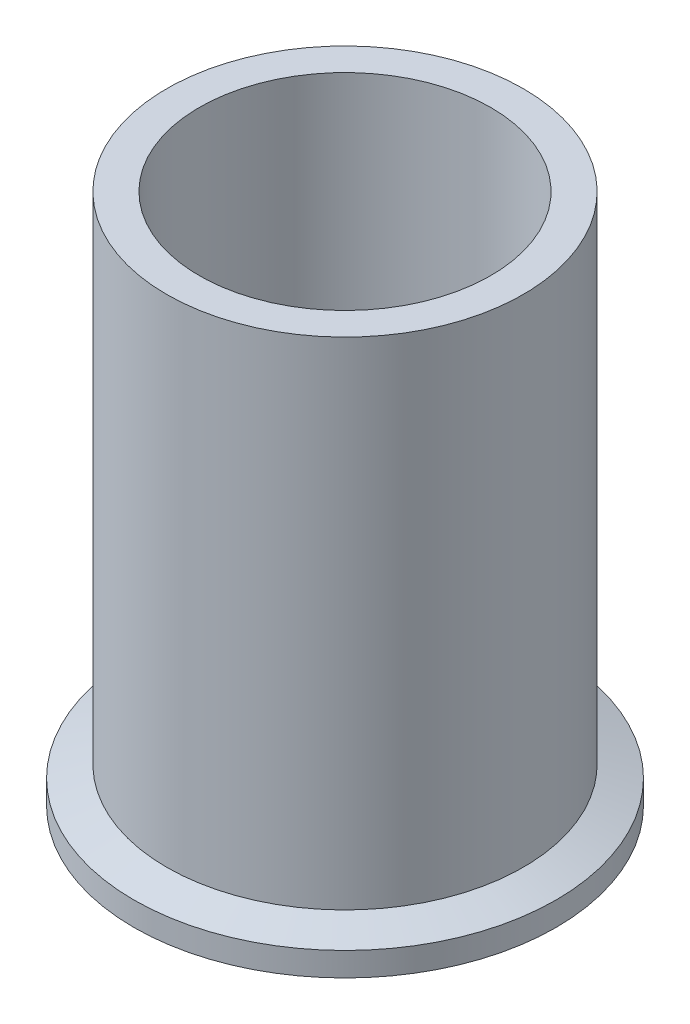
ISO-10303-21;
HEADER;
FILE_DESCRIPTION(('STEP AP214'),'2;1');
FILE_NAME('part.step','',(''),(''),'','','');
FILE_SCHEMA(('AUTOMOTIVE_DESIGN { 1 0 10303 214 1 1 1 1 }'));
ENDSEC;
DATA;
#1=APPLICATION_CONTEXT('core data for automotive mechanical design processes');
#2=APPLICATION_PROTOCOL_DEFINITION('international standard','automotive_design',2000,#1);
#3=PRODUCT_CONTEXT('',#1,'mechanical');
#4=PRODUCT('Part','Part','',(#3));
#5=PRODUCT_RELATED_PRODUCT_CATEGORY('part','',(#4));
#6=PRODUCT_DEFINITION_FORMATION('','',#4);
#7=PRODUCT_DEFINITION_CONTEXT('part definition',#1,'design');
#8=PRODUCT_DEFINITION('design','',#6,#7);
#9=PRODUCT_DEFINITION_SHAPE('','',#8);
#10=(LENGTH_UNIT() NAMED_UNIT(*) SI_UNIT(.MILLI.,.METRE.));
#11=(NAMED_UNIT(*) PLANE_ANGLE_UNIT() SI_UNIT($,.RADIAN.));
#12=(NAMED_UNIT(*) SI_UNIT($,.STERADIAN.) SOLID_ANGLE_UNIT());
#13=UNCERTAINTY_MEASURE_WITH_UNIT(LENGTH_MEASURE(1.E-05),#10,'distance_accuracy_value','');
#14=(GEOMETRIC_REPRESENTATION_CONTEXT(3) GLOBAL_UNCERTAINTY_ASSIGNED_CONTEXT((#13)) GLOBAL_UNIT_ASSIGNED_CONTEXT((#10,
#11,#12)) REPRESENTATION_CONTEXT('',''));
#15=CARTESIAN_POINT('',(0.,0.,0.));
#16=DIRECTION('',(0.,0.,1.));
#17=DIRECTION('',(1.,0.,0.));
#18=AXIS2_PLACEMENT_3D('',#15,#16,#17);
#19=CARTESIAN_POINT('',(0.,0.7874,0.));
#20=DIRECTION('',(0.,-1.,0.));
#21=DIRECTION('',(0.,0.,-1.));
#22=AXIS2_PLACEMENT_3D('',#19,#20,#21);
#23=TOROIDAL_SURFACE('',#22,23.6366084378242,0.787399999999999);
#24=CARTESIAN_POINT('',(0.,0.,0.));
#25=DIRECTION('',(0.,-1.,0.));
#26=DIRECTION('',(0.,0.,-1.));
#27=AXIS2_PLACEMENT_3D('',#24,#25,#26);
#28=CIRCLE('',#27,23.6366084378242);
#29=CARTESIAN_POINT('',(0.,0.,-23.6366084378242));
#30=VERTEX_POINT('',#29);
#31=EDGE_CURVE('E67',#30,#30,#28,.T.);
#32=ORIENTED_EDGE('',*,*,#31,.T.);
#33=EDGE_LOOP('',(#32));
#34=FACE_BOUND('',#33,.T.);
#35=CARTESIAN_POINT('',(0.,0.474458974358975,0.));
#36=DIRECTION('',(0.,-1.,0.));
#37=DIRECTION('',(0.,0.,-1.));
#38=AXIS2_PLACEMENT_3D('',#35,#36,#37);
#39=CIRCLE('',#38,22.9140666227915);
#40=CARTESIAN_POINT('',(0.,0.474458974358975,-22.9140666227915));
#41=VERTEX_POINT('',#40);
#42=EDGE_CURVE('E10',#41,#41,#39,.T.);
#43=ORIENTED_EDGE('',*,*,#42,.F.);
#44=EDGE_LOOP('',(#43));
#45=FACE_BOUND('',#44,.T.);
#46=ADVANCED_FACE('F33',(#34,#45),#23,.T.);
#47=CARTESIAN_POINT('',(0.,0.,0.));
#48=DIRECTION('',(0.,-1.,0.));
#49=DIRECTION('',(0.,0.,-1.));
#50=AXIS2_PLACEMENT_3D('',#47,#48,#49);
#51=TOROIDAL_SURFACE('',#50,21.8186,1.1938);
#52=CARTESIAN_POINT('',(0.,0.474458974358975,0.));
#53=DIRECTION('',(0.,-1.,0.));
#54=DIRECTION('',(0.,0.,-1.));
#55=AXIS2_PLACEMENT_3D('',#52,#53,#54);
#56=CIRCLE('',#55,20.7231333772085);
#57=CARTESIAN_POINT('',(0.,0.474458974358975,-20.7231333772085));
#58=VERTEX_POINT('',#57);
#59=EDGE_CURVE('E39',#58,#58,#56,.T.);
#60=ORIENTED_EDGE('',*,*,#59,.F.);
#61=EDGE_LOOP('',(#60));
#62=FACE_BOUND('',#61,.T.);
#63=ORIENTED_EDGE('',*,*,#42,.T.);
#64=EDGE_LOOP('',(#63));
#65=FACE_BOUND('',#64,.T.);
#66=ADVANCED_FACE('F115',(#62,#65),#51,.F.);
#67=CARTESIAN_POINT('',(0.,0.787400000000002,0.));
#68=DIRECTION('',(0.,-1.,0.));
#69=DIRECTION('',(0.,0.,-1.));
#70=AXIS2_PLACEMENT_3D('',#67,#68,#69);
#71=TOROIDAL_SURFACE('',#70,20.0005915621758,0.787399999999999);
#72=ORIENTED_EDGE('',*,*,#59,.T.);
#73=EDGE_LOOP('',(#72));
#74=FACE_BOUND('',#73,.T.);
#75=CARTESIAN_POINT('',(0.,0.,0.));
#76=DIRECTION('',(0.,-1.,0.));
#77=DIRECTION('',(0.,0.,-1.));
#78=AXIS2_PLACEMENT_3D('',#75,#76,#77);
#79=CIRCLE('',#78,20.0005915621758);
#80=CARTESIAN_POINT('',(0.,0.,-20.0005915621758));
#81=VERTEX_POINT('',#80);
#82=EDGE_CURVE('E43',#81,#81,#79,.T.);
#83=ORIENTED_EDGE('',*,*,#82,.F.);
#84=EDGE_LOOP('',(#83));
#85=FACE_BOUND('',#84,.T.);
#86=ADVANCED_FACE('F111',(#74,#85),#71,.T.);
#87=CARTESIAN_POINT('',(0.,0.,0.));
#88=DIRECTION('',(0.,1.,0.));
#89=DIRECTION('',(0.,0.,1.));
#90=AXIS2_PLACEMENT_3D('',#87,#88,#89);
#91=PLANE('',#90);
#92=CARTESIAN_POINT('',(0.,0.,0.));
#93=DIRECTION('',(0.,-1.,0.));
#94=DIRECTION('',(0.,0.,-1.));
#95=AXIS2_PLACEMENT_3D('',#92,#93,#94);
#96=CIRCLE('',#95,17.399);
#97=CARTESIAN_POINT('',(0.,0.,-17.399));
#98=VERTEX_POINT('',#97);
#99=EDGE_CURVE('E47',#98,#98,#96,.T.);
#100=ORIENTED_EDGE('',*,*,#99,.F.);
#101=EDGE_LOOP('',(#100));
#102=FACE_BOUND('',#101,.T.);
#103=ORIENTED_EDGE('',*,*,#82,.T.);
#104=EDGE_LOOP('',(#103));
#105=FACE_BOUND('',#104,.T.);
#106=ADVANCED_FACE('F105',(#102,#105),#91,.F.);
#107=CARTESIAN_POINT('',(0.,0.,0.));
#108=DIRECTION('',(0.,-1.,0.));
#109=DIRECTION('',(0.,0.,-1.));
#110=AXIS2_PLACEMENT_3D('',#107,#108,#109);
#111=CYLINDRICAL_SURFACE('',#110,17.399);
#112=ORIENTED_EDGE('',*,*,#99,.T.);
#113=EDGE_LOOP('',(#112));
#114=FACE_BOUND('',#113,.T.);
#115=CARTESIAN_POINT('',(0.,63.5,0.));
#116=DIRECTION('',(0.,-1.,0.));
#117=DIRECTION('',(0.,0.,-1.));
#118=AXIS2_PLACEMENT_3D('',#115,#116,#117);
#119=CIRCLE('',#118,17.399);
#120=CARTESIAN_POINT('',(0.,63.5,-17.399));
#121=VERTEX_POINT('',#120);
#122=EDGE_CURVE('E52',#121,#121,#119,.T.);
#123=ORIENTED_EDGE('',*,*,#122,.F.);
#124=EDGE_LOOP('',(#123));
#125=FACE_BOUND('',#124,.T.);
#126=ADVANCED_FACE('F100',(#114,#125),#111,.F.);
#127=CARTESIAN_POINT('',(0.,63.5,0.));
#128=DIRECTION('',(0.,-1.,0.));
#129=DIRECTION('',(0.,0.,-1.));
#130=AXIS2_PLACEMENT_3D('',#127,#128,#129);
#131=PLANE('',#130);
#132=CARTESIAN_POINT('',(0.,63.5,0.));
#133=DIRECTION('',(0.,-1.,0.));
#134=DIRECTION('',(0.,0.,-1.));
#135=AXIS2_PLACEMENT_3D('',#132,#133,#134);
#136=CIRCLE('',#135,21.2852);
#137=CARTESIAN_POINT('',(0.,63.5,-21.2852));
#138=VERTEX_POINT('',#137);
#139=EDGE_CURVE('E55',#138,#138,#136,.T.);
#140=ORIENTED_EDGE('',*,*,#139,.F.);
#141=EDGE_LOOP('',(#140));
#142=FACE_BOUND('',#141,.T.);
#143=ORIENTED_EDGE('',*,*,#122,.T.);
#144=EDGE_LOOP('',(#143));
#145=FACE_BOUND('',#144,.T.);
#146=ADVANCED_FACE('F94',(#142,#145),#131,.F.);
#147=CARTESIAN_POINT('',(0.,0.,0.));
#148=DIRECTION('',(0.,-1.,0.));
#149=DIRECTION('',(0.,0.,-1.));
#150=AXIS2_PLACEMENT_3D('',#147,#148,#149);
#151=CYLINDRICAL_SURFACE('',#150,21.2852);
#152=CARTESIAN_POINT('',(0.,4.26850596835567,0.));
#153=DIRECTION('',(0.,-1.,0.));
#154=DIRECTION('',(0.,0.,-1.));
#155=AXIS2_PLACEMENT_3D('',#152,#153,#154);
#156=CIRCLE('',#155,21.2852);
#157=CARTESIAN_POINT('',(0.,4.26850596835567,-21.2852));
#158=VERTEX_POINT('',#157);
#159=EDGE_CURVE('E58',#158,#158,#156,.T.);
#160=ORIENTED_EDGE('',*,*,#159,.F.);
#161=EDGE_LOOP('',(#160));
#162=FACE_BOUND('',#161,.T.);
#163=ORIENTED_EDGE('',*,*,#139,.T.);
#164=EDGE_LOOP('',(#163));
#165=FACE_BOUND('',#164,.T.);
#166=ADVANCED_FACE('F88',(#162,#165),#151,.T.);
#167=CARTESIAN_POINT('',(0.,4.26850596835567,0.));
#168=DIRECTION('',(0.,-1.,0.));
#169=DIRECTION('',(0.,0.,-1.));
#170=AXIS2_PLACEMENT_3D('',#167,#168,#169);
#171=CONICAL_SURFACE('',#170,21.2852,1.22173047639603);
#172=CARTESIAN_POINT('',(0.,2.8448,0.));
#173=DIRECTION('',(0.,-1.,0.));
#174=DIRECTION('',(0.,0.,-1.));
#175=AXIS2_PLACEMENT_3D('',#172,#173,#174);
#176=CIRCLE('',#175,25.1968);
#177=CARTESIAN_POINT('',(0.,2.8448,-25.1968));
#178=VERTEX_POINT('',#177);
#179=EDGE_CURVE('E61',#178,#178,#176,.T.);
#180=ORIENTED_EDGE('',*,*,#179,.F.);
#181=EDGE_LOOP('',(#180));
#182=FACE_BOUND('',#181,.T.);
#183=ORIENTED_EDGE('',*,*,#159,.T.);
#184=EDGE_LOOP('',(#183));
#185=FACE_BOUND('',#184,.T.);
#186=ADVANCED_FACE('F82',(#182,#185),#171,.T.);
#187=CARTESIAN_POINT('',(0.,0.,0.));
#188=DIRECTION('',(0.,-1.,0.));
#189=DIRECTION('',(0.,0.,-1.));
#190=AXIS2_PLACEMENT_3D('',#187,#188,#189);
#191=CYLINDRICAL_SURFACE('',#190,25.1968);
#192=CARTESIAN_POINT('',(0.,0.,0.));
#193=DIRECTION('',(0.,-1.,0.));
#194=DIRECTION('',(0.,0.,-1.));
#195=AXIS2_PLACEMENT_3D('',#192,#193,#194);
#196=CIRCLE('',#195,25.1968);
#197=CARTESIAN_POINT('',(0.,0.,-25.1968));
#198=VERTEX_POINT('',#197);
#199=EDGE_CURVE('E64',#198,#198,#196,.T.);
#200=ORIENTED_EDGE('',*,*,#199,.F.);
#201=EDGE_LOOP('',(#200));
#202=FACE_BOUND('',#201,.T.);
#203=ORIENTED_EDGE('',*,*,#179,.T.);
#204=EDGE_LOOP('',(#203));
#205=FACE_BOUND('',#204,.T.);
#206=ADVANCED_FACE('F76',(#202,#205),#191,.T.);
#207=CARTESIAN_POINT('',(0.,0.,0.));
#208=DIRECTION('',(0.,1.,0.));
#209=DIRECTION('',(0.,0.,1.));
#210=AXIS2_PLACEMENT_3D('',#207,#208,#209);
#211=PLANE('',#210);
#212=ORIENTED_EDGE('',*,*,#31,.F.);
#213=EDGE_LOOP('',(#212));
#214=FACE_BOUND('',#213,.T.);
#215=ORIENTED_EDGE('',*,*,#199,.T.);
#216=EDGE_LOOP('',(#215));
#217=FACE_BOUND('',#216,.T.);
#218=ADVANCED_FACE('F73',(#214,#217),#211,.F.);
#219=CLOSED_SHELL('',(#46,#66,#86,#106,#126,#146,#166,#186,#206,#218));
#220=MANIFOLD_SOLID_BREP('B2',#219);
#221=ADVANCED_BREP_SHAPE_REPRESENTATION('',(#18,#220),#14);
#222=SHAPE_DEFINITION_REPRESENTATION(#9,#221);
ENDSEC;
END-ISO-10303-21;
